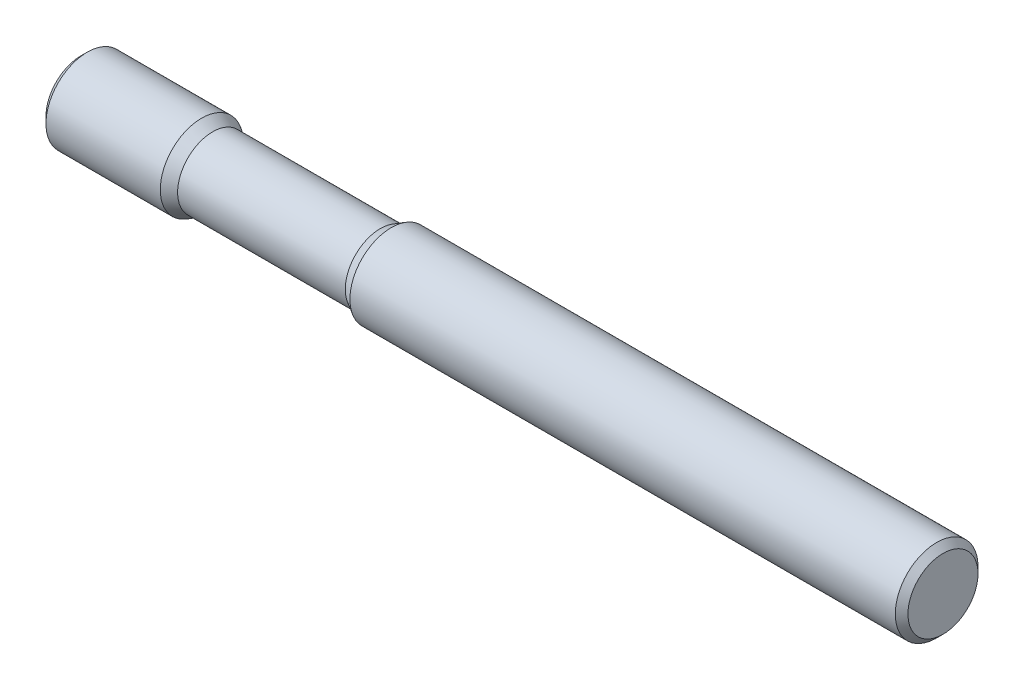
ISO-10303-21;
HEADER;
FILE_DESCRIPTION(('STEP AP214'),'2;1');
FILE_NAME('part.step','',(''),(''),'','','');
FILE_SCHEMA(('AUTOMOTIVE_DESIGN { 1 0 10303 214 1 1 1 1 }'));
ENDSEC;
DATA;
#1=APPLICATION_CONTEXT('core data for automotive mechanical design processes');
#2=APPLICATION_PROTOCOL_DEFINITION('international standard','automotive_design',2000,#1);
#3=PRODUCT_CONTEXT('',#1,'mechanical');
#4=PRODUCT('Part','Part','',(#3));
#5=PRODUCT_RELATED_PRODUCT_CATEGORY('part','',(#4));
#6=PRODUCT_DEFINITION_FORMATION('','',#4);
#7=PRODUCT_DEFINITION_CONTEXT('part definition',#1,'design');
#8=PRODUCT_DEFINITION('design','',#6,#7);
#9=PRODUCT_DEFINITION_SHAPE('','',#8);
#10=(LENGTH_UNIT() NAMED_UNIT(*) SI_UNIT(.MILLI.,.METRE.));
#11=(NAMED_UNIT(*) PLANE_ANGLE_UNIT() SI_UNIT($,.RADIAN.));
#12=(NAMED_UNIT(*) SI_UNIT($,.STERADIAN.) SOLID_ANGLE_UNIT());
#13=UNCERTAINTY_MEASURE_WITH_UNIT(LENGTH_MEASURE(1.E-05),#10,'distance_accuracy_value','');
#14=(GEOMETRIC_REPRESENTATION_CONTEXT(3) GLOBAL_UNCERTAINTY_ASSIGNED_CONTEXT((#13)) GLOBAL_UNIT_ASSIGNED_CONTEXT((#10,
#11,#12)) REPRESENTATION_CONTEXT('',''));
#15=CARTESIAN_POINT('',(0.,0.,0.));
#16=DIRECTION('',(0.,0.,1.));
#17=DIRECTION('',(1.,0.,0.));
#18=AXIS2_PLACEMENT_3D('',#15,#16,#17);
#19=CARTESIAN_POINT('',(0.,0.,0.));
#20=DIRECTION('',(-1.,0.,0.));
#21=DIRECTION('',(0.,0.,1.));
#22=AXIS2_PLACEMENT_3D('',#19,#20,#21);
#23=PLANE('',#22);
#24=CARTESIAN_POINT('',(0.,0.,0.));
#25=DIRECTION('',(1.,0.,0.));
#26=DIRECTION('',(0.,0.,-1.));
#27=AXIS2_PLACEMENT_3D('',#24,#25,#26);
#28=CIRCLE('',#27,10.159695);
#29=CARTESIAN_POINT('',(0.,0.,-10.159695));
#30=VERTEX_POINT('',#29);
#31=EDGE_CURVE('E10',#30,#30,#28,.T.);
#32=ORIENTED_EDGE('',*,*,#31,.F.);
#33=EDGE_LOOP('',(#32));
#34=FACE_BOUND('',#33,.T.);
#35=ADVANCED_FACE('F36',(#34),#23,.T.);
#36=CARTESIAN_POINT('',(1.84030500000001,0.,0.));
#37=DIRECTION('',(1.,0.,0.));
#38=DIRECTION('',(0.,0.,-1.));
#39=AXIS2_PLACEMENT_3D('',#36,#37,#38);
#40=CONICAL_SURFACE('',#39,12.,0.785398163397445);
#41=ORIENTED_EDGE('',*,*,#31,.T.);
#42=EDGE_LOOP('',(#41));
#43=FACE_BOUND('',#42,.T.);
#44=CARTESIAN_POINT('',(1.84030500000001,0.,0.));
#45=DIRECTION('',(1.,0.,0.));
#46=DIRECTION('',(0.,0.,-1.));
#47=AXIS2_PLACEMENT_3D('',#44,#45,#46);
#48=CIRCLE('',#47,12.);
#49=CARTESIAN_POINT('',(1.84030500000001,0.,-12.));
#50=VERTEX_POINT('',#49);
#51=EDGE_CURVE('E42',#50,#50,#48,.T.);
#52=ORIENTED_EDGE('',*,*,#51,.F.);
#53=EDGE_LOOP('',(#52));
#54=FACE_BOUND('',#53,.T.);
#55=ADVANCED_FACE('F84',(#43,#54),#40,.T.);
#56=CARTESIAN_POINT('',(250.,0.,0.));
#57=DIRECTION('',(1.,0.,0.));
#58=DIRECTION('',(0.,0.,-1.));
#59=AXIS2_PLACEMENT_3D('',#56,#57,#58);
#60=CYLINDRICAL_SURFACE('',#59,12.);
#61=ORIENTED_EDGE('',*,*,#51,.T.);
#62=EDGE_LOOP('',(#61));
#63=FACE_BOUND('',#62,.T.);
#64=CARTESIAN_POINT('',(35.,0.,0.));
#65=DIRECTION('',(1.,0.,0.));
#66=DIRECTION('',(0.,0.,-1.));
#67=AXIS2_PLACEMENT_3D('',#64,#65,#66);
#68=CIRCLE('',#67,12.);
#69=CARTESIAN_POINT('',(35.,0.,-12.));
#70=VERTEX_POINT('',#69);
#71=EDGE_CURVE('E46',#70,#70,#68,.T.);
#72=ORIENTED_EDGE('',*,*,#71,.F.);
#73=EDGE_LOOP('',(#72));
#74=FACE_BOUND('',#73,.T.);
#75=ADVANCED_FACE('F89',(#63,#74),#60,.T.);
#76=CARTESIAN_POINT('',(38.187501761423,0.,0.));
#77=DIRECTION('',(-1.,0.,0.));
#78=DIRECTION('',(0.,0.,1.));
#79=AXIS2_PLACEMENT_3D('',#76,#77,#78);
#80=CONICAL_SURFACE('',#79,10.159695,0.523598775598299);
#81=ORIENTED_EDGE('',*,*,#71,.T.);
#82=EDGE_LOOP('',(#81));
#83=FACE_BOUND('',#82,.T.);
#84=CARTESIAN_POINT('',(38.187501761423,0.,0.));
#85=DIRECTION('',(1.,0.,0.));
#86=DIRECTION('',(0.,0.,-1.));
#87=AXIS2_PLACEMENT_3D('',#84,#85,#86);
#88=CIRCLE('',#87,10.159695);
#89=CARTESIAN_POINT('',(38.187501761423,0.,-10.159695));
#90=VERTEX_POINT('',#89);
#91=EDGE_CURVE('E50',#90,#90,#88,.T.);
#92=ORIENTED_EDGE('',*,*,#91,.F.);
#93=EDGE_LOOP('',(#92));
#94=FACE_BOUND('',#93,.T.);
#95=ADVANCED_FACE('F93',(#83,#94),#80,.T.);
#96=CARTESIAN_POINT('',(250.,0.,0.));
#97=DIRECTION('',(1.,0.,0.));
#98=DIRECTION('',(0.,0.,-1.));
#99=AXIS2_PLACEMENT_3D('',#96,#97,#98);
#100=CYLINDRICAL_SURFACE('',#99,10.159695);
#101=ORIENTED_EDGE('',*,*,#91,.T.);
#102=EDGE_LOOP('',(#101));
#103=FACE_BOUND('',#102,.T.);
#104=CARTESIAN_POINT('',(86.8124982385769,0.,0.));
#105=DIRECTION('',(1.,0.,0.));
#106=DIRECTION('',(0.,0.,-1.));
#107=AXIS2_PLACEMENT_3D('',#104,#105,#106);
#108=CIRCLE('',#107,10.159695);
#109=CARTESIAN_POINT('',(86.8124982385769,0.,-10.159695));
#110=VERTEX_POINT('',#109);
#111=EDGE_CURVE('E55',#110,#110,#108,.T.);
#112=ORIENTED_EDGE('',*,*,#111,.F.);
#113=EDGE_LOOP('',(#112));
#114=FACE_BOUND('',#113,.T.);
#115=ADVANCED_FACE('F99',(#103,#114),#100,.T.);
#116=CARTESIAN_POINT('',(90.,0.,0.));
#117=DIRECTION('',(1.,0.,0.));
#118=DIRECTION('',(0.,0.,-1.));
#119=AXIS2_PLACEMENT_3D('',#116,#117,#118);
#120=CONICAL_SURFACE('',#119,12.,0.523598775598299);
#121=ORIENTED_EDGE('',*,*,#111,.T.);
#122=EDGE_LOOP('',(#121));
#123=FACE_BOUND('',#122,.T.);
#124=CARTESIAN_POINT('',(90.,0.,0.));
#125=DIRECTION('',(1.,0.,0.));
#126=DIRECTION('',(0.,0.,-1.));
#127=AXIS2_PLACEMENT_3D('',#124,#125,#126);
#128=CIRCLE('',#127,12.);
#129=CARTESIAN_POINT('',(90.,0.,-12.));
#130=VERTEX_POINT('',#129);
#131=EDGE_CURVE('E58',#130,#130,#128,.T.);
#132=ORIENTED_EDGE('',*,*,#131,.F.);
#133=EDGE_LOOP('',(#132));
#134=FACE_BOUND('',#133,.T.);
#135=ADVANCED_FACE('F80',(#123,#134),#120,.T.);
#136=CARTESIAN_POINT('',(250.,0.,0.));
#137=DIRECTION('',(1.,0.,0.));
#138=DIRECTION('',(0.,0.,-1.));
#139=AXIS2_PLACEMENT_3D('',#136,#137,#138);
#140=CYLINDRICAL_SURFACE('',#139,12.);
#141=ORIENTED_EDGE('',*,*,#131,.T.);
#142=EDGE_LOOP('',(#141));
#143=FACE_BOUND('',#142,.T.);
#144=CARTESIAN_POINT('',(248.159695,0.,0.));
#145=DIRECTION('',(1.,0.,0.));
#146=DIRECTION('',(0.,0.,-1.));
#147=AXIS2_PLACEMENT_3D('',#144,#145,#146);
#148=CIRCLE('',#147,12.);
#149=CARTESIAN_POINT('',(248.159695,0.,-12.));
#150=VERTEX_POINT('',#149);
#151=EDGE_CURVE('E61',#150,#150,#148,.T.);
#152=ORIENTED_EDGE('',*,*,#151,.F.);
#153=EDGE_LOOP('',(#152));
#154=FACE_BOUND('',#153,.T.);
#155=ADVANCED_FACE('F72',(#143,#154),#140,.T.);
#156=CARTESIAN_POINT('',(250.,0.,0.));
#157=DIRECTION('',(-1.,0.,0.));
#158=DIRECTION('',(0.,0.,1.));
#159=AXIS2_PLACEMENT_3D('',#156,#157,#158);
#160=CONICAL_SURFACE('',#159,10.159695,0.785398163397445);
#161=ORIENTED_EDGE('',*,*,#151,.T.);
#162=EDGE_LOOP('',(#161));
#163=FACE_BOUND('',#162,.T.);
#164=CARTESIAN_POINT('',(250.,0.,0.));
#165=DIRECTION('',(1.,0.,0.));
#166=DIRECTION('',(0.,0.,-1.));
#167=AXIS2_PLACEMENT_3D('',#164,#165,#166);
#168=CIRCLE('',#167,10.159695);
#169=CARTESIAN_POINT('',(250.,0.,-10.159695));
#170=VERTEX_POINT('',#169);
#171=EDGE_CURVE('E64',#170,#170,#168,.T.);
#172=ORIENTED_EDGE('',*,*,#171,.F.);
#173=EDGE_LOOP('',(#172));
#174=FACE_BOUND('',#173,.T.);
#175=ADVANCED_FACE('F70',(#163,#174),#160,.T.);
#176=CARTESIAN_POINT('',(250.,10.159695,0.));
#177=DIRECTION('',(1.,0.,0.));
#178=DIRECTION('',(0.,0.,-1.));
#179=AXIS2_PLACEMENT_3D('',#176,#177,#178);
#180=PLANE('',#179);
#181=ORIENTED_EDGE('',*,*,#171,.T.);
#182=EDGE_LOOP('',(#181));
#183=FACE_BOUND('',#182,.T.);
#184=ADVANCED_FACE('F68',(#183),#180,.T.);
#185=CLOSED_SHELL('',(#35,#55,#75,#95,#115,#135,#155,#175,#184));
#186=MANIFOLD_SOLID_BREP('B2',#185);
#187=ADVANCED_BREP_SHAPE_REPRESENTATION('',(#18,#186),#14);
#188=SHAPE_DEFINITION_REPRESENTATION(#9,#187);
ENDSEC;
END-ISO-10303-21;
